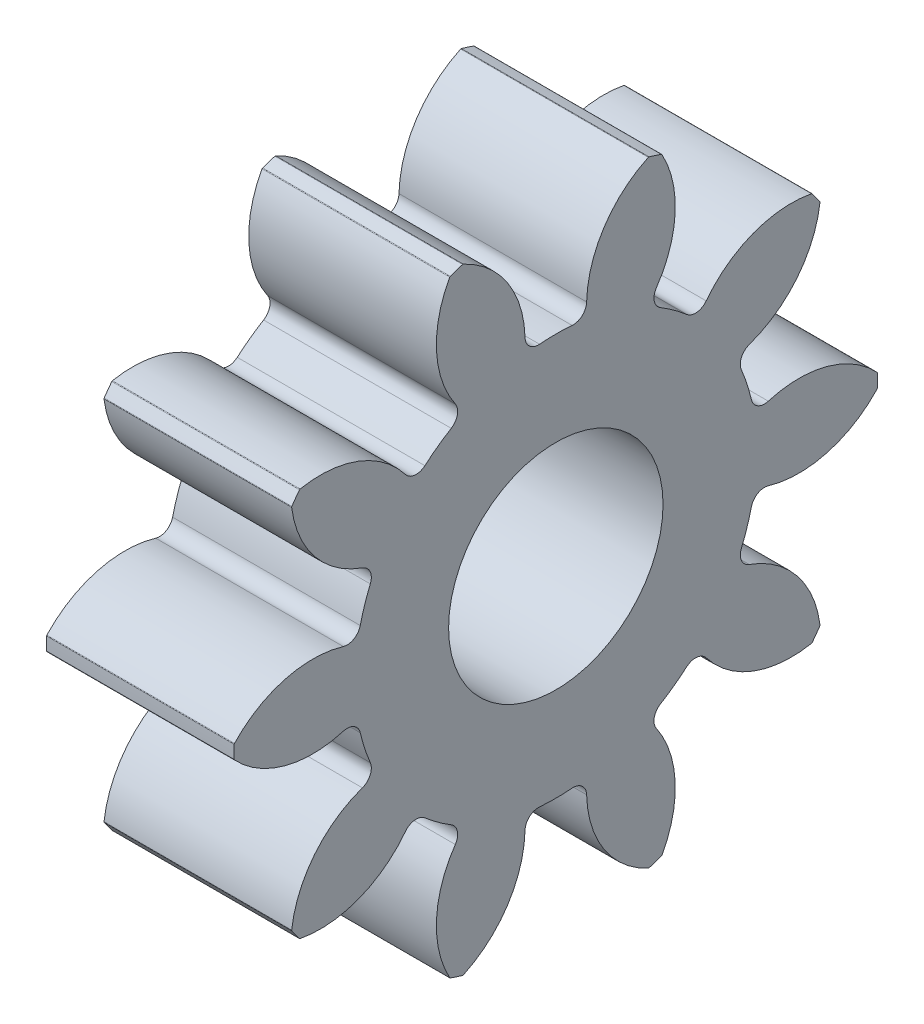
from build123d import *

# Parameters (mm, degrees)
BASPROSKE_W                = 7
BASPROSKE_H                = 12
TOOTHCUT_DEPTH             = 19.357559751
BREAKS_R                   = 0.04
ROOTFILLETS_R              = 0.501
TEETHCUTS_COUNT            = 10
TEETHCUTS_ANGLE            = 324
BREAKS_OF_TEETHCUTS_R      = 0.04
ROOTFILLETS_OF_TEETHCUTS_R = 0.501
BORSKE_R                   = 0.4
BORE_DEPTH                 = 50.0000508
SKETCH_1_R                 = 4
CUT_EXTRUDE_1_DEPTH        = 19.026231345


with BuildPart() as part:
    # BasProSke → Base-Revolve (revolve)
    with BuildSketch(Plane(origin=(0, 0, 0), x_dir=(1, 0, 0), z_dir=(0, 1, 0)), mode=Mode.PRIVATE) as base_revolve_sk:
        with Locations((3.5, 6)):
            Rectangle(BASPROSKE_W, BASPROSKE_H)
    revolve(base_revolve_sk.sketch.rotate(Axis((-10, 0, 0), (1, 0, 0)), 180), axis=Axis((-10, 0, 0), (1, 0, 0)))

    # TooCutSke → ToothCut (cut, through all)
    with BuildSketch(Plane(origin=(0, 0, 0), x_dir=(0, 0, -1), z_dir=(1, 0, 0))):
        with BuildLine():
            ThreePointArc((1.173662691, 7.406586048), (0, 7.499), (-1.173662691, 7.406586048))
            ThreePointArc((-1.173662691, 7.406586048), (-1.668191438, 9.834565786), (-3.497907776, 11.50542856))
            ThreePointArc((-3.497907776, 11.50542856), (0, 12.0254), (3.497907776, 11.50542856))
            ThreePointArc((3.497907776, 11.50542856), (1.668191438, 9.834565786), (1.173662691, 7.406586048))
        make_face()
    toothcut = extrude(amount=TOOTHCUT_DEPTH, mode=Mode.SUBTRACT)

    # Breaks
    breaks_edges = [part.edges().sort_by_distance(p)[0] for p in [
        (3.5, 11.489443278, -3.463046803),
        (3.5, 11.489443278, 3.463046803),
    ]]
    fillet(breaks_edges, radius=BREAKS_R)

    # RootFillets
    rootfillets_edges = [part.edges().sort_by_distance(p)[0] for p in [
        (3.5, 7.406586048, -1.173662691),
        (3.5, 7.406586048, 1.173662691),
    ]]
    fillet(rootfillets_edges, radius=ROOTFILLETS_R)

    # TeethCuts: ToothCut ×10 about axis
    teethcuts_axis = Axis((-10, 0, 0), (1, 0, 0))
    for i in range(1, TEETHCUTS_COUNT):
        add(toothcut.rotate(teethcuts_axis, i * TEETHCUTS_ANGLE / (TEETHCUTS_COUNT - 1)), mode=Mode.SUBTRACT)

    # Breaks of TeethCuts
    breaks_of_teethcuts_edges = [part.edges().sort_by_distance(p)[0] for p in [
        (3.5, 11.330682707, 3.9516616),
        (3.5, 7.259627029, 9.554989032),
        (3.5, 6.843986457, 9.856969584),
        (3.5, 0.256880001, 11.997250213),
        (3.5, -0.256880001, 11.997250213),
        (3.5, -6.843986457, 9.856969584),
        (3.5, -7.259627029, 9.554989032),
        (3.5, -11.330682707, 3.9516616),
        (3.5, -11.489443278, 3.463046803),
        (3.5, -11.489443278, -3.463046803),
        (3.5, -11.330682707, -3.9516616),
        (3.5, -7.259627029, -9.554989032),
        (3.5, -6.843986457, -9.856969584),
        (3.5, -0.256880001, -11.997250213),
        (3.5, 0.256880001, -11.997250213),
        (3.5, 6.843986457, -9.856969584),
        (3.5, 7.259627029, -9.554989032),
        (3.5, 11.330682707, -3.9516616),
    ]]
    fillet(breaks_of_teethcuts_edges, radius=BREAKS_OF_TEETHCUTS_R)

    # RootFillets of TeethCuts
    rootfillets_of_teethcuts_edges = [part.edges().sort_by_distance(p)[0] for p in [
        (3.5, 6.681915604, 3.403968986),
        (3.5, 5.302192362, 5.302995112),
        (3.5, 3.404980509, 6.681400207),
        (3.5, 1.172541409, 7.406763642),
        (3.5, -1.172541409, 7.406763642),
        (3.5, -3.404980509, 6.681400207),
        (3.5, -5.302192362, 5.302995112),
        (3.5, -6.681915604, 3.403968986),
        (3.5, -7.406586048, 1.173662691),
        (3.5, -7.406586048, -1.173662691),
        (3.5, -6.681915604, -3.403968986),
        (3.5, -5.302192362, -5.302995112),
        (3.5, -3.404980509, -6.681400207),
        (3.5, -1.172541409, -7.406763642),
        (3.5, 1.172541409, -7.406763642),
        (3.5, 3.404980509, -6.681400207),
        (3.5, 5.302192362, -5.302995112),
        (3.5, 6.681915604, -3.403968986),
    ]]
    fillet(rootfillets_of_teethcuts_edges, radius=ROOTFILLETS_OF_TEETHCUTS_R)

    # BorSke → Bore (cut, symmetric)
    with BuildSketch(Plane(origin=(0, 0, 0), x_dir=(0, 0, -1), z_dir=(1, 0, 0))):
        with Locations(Location((0, 0, 0), (0, 0, 180))):
            Circle(BORSKE_R)
    extrude(amount=BORE_DEPTH, both=True, mode=Mode.SUBTRACT)

    # Sketch 1 → Cut-Extrude 1 (cut, through all)
    with BuildSketch(Plane.ZY):
        Circle(SKETCH_1_R)
    extrude(amount=-CUT_EXTRUDE_1_DEPTH, mode=Mode.SUBTRACT)


solid = part.part
